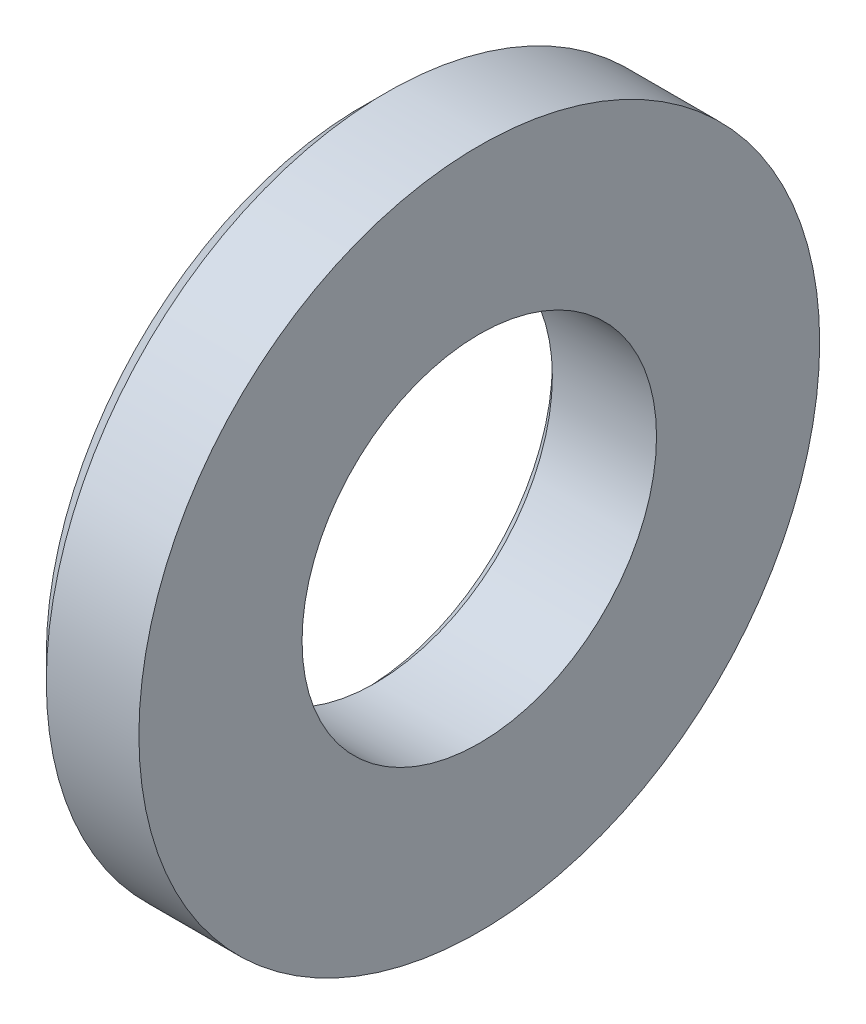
from build123d import *

# Parameters (mm, degrees)
SKETCH3_R           = 19.05
SKETCH3_R_2         = 9.9187
BOSS_EXTRUDE1_DEPTH = 3.2385
CHAMFER1_SIZE       = 1.2954
CHAMFER2_SIZE       = 0.6477


with BuildPart() as part:
    # Sketch3 → Boss-Extrude1 (new, symmetric)
    with BuildSketch(Plane(origin=(0, 0, 0), x_dir=(0, 0, -1), z_dir=(1, 0, 0))):
        Circle(SKETCH3_R)
        Circle(SKETCH3_R_2, mode=Mode.SUBTRACT)
    extrude(amount=BOSS_EXTRUDE1_DEPTH, both=True)

    # Chamfer1
    chamfer1_edges = [part.edges().sort_by_distance(p)[0] for p in [
        (-3.2385, 0, 19.05),
    ]]
    chamfer(chamfer1_edges, length=CHAMFER1_SIZE)

    # Chamfer2
    chamfer2_edges = [part.edges().sort_by_distance(p)[0] for p in [
        (-3.2385, 0, 9.9187),
    ]]
    chamfer(chamfer2_edges, length=CHAMFER2_SIZE)


solid = part.part
